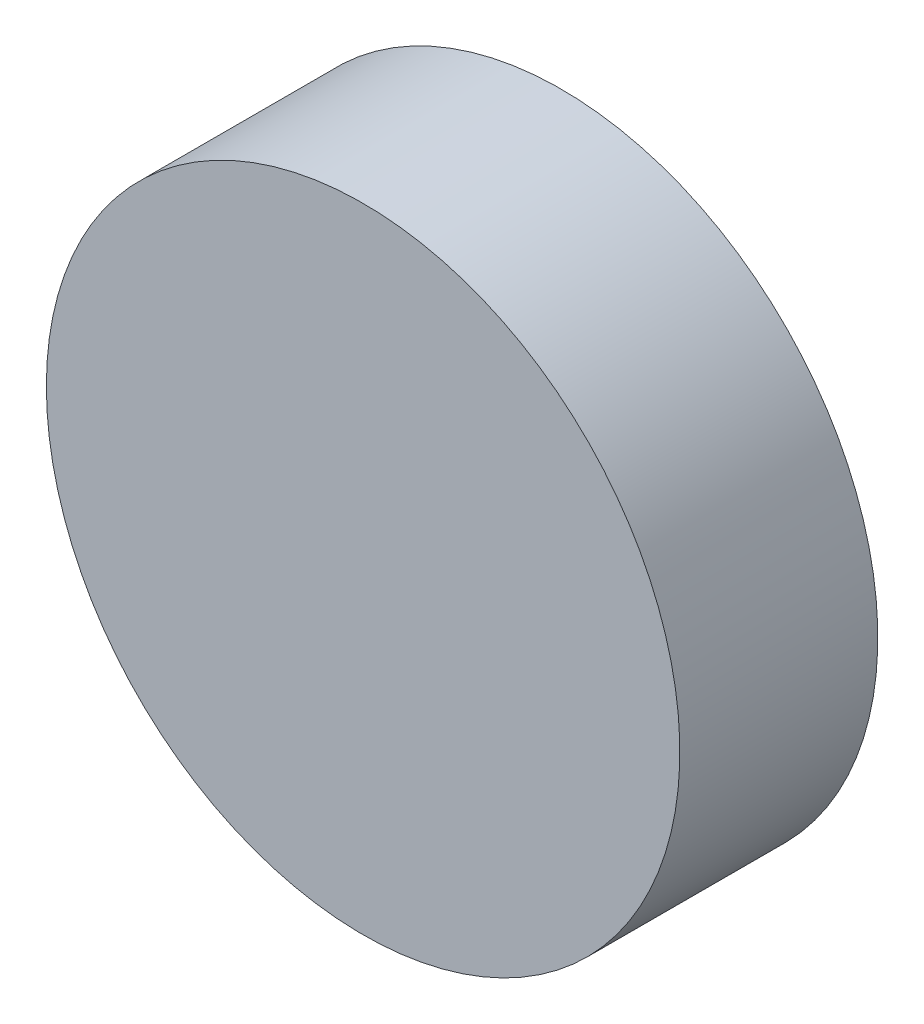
ISO-10303-21;
HEADER;
FILE_DESCRIPTION(('STEP AP214'),'2;1');
FILE_NAME('part.step','',(''),(''),'','','');
FILE_SCHEMA(('AUTOMOTIVE_DESIGN { 1 0 10303 214 1 1 1 1 }'));
ENDSEC;
DATA;
#1=APPLICATION_CONTEXT('core data for automotive mechanical design processes');
#2=APPLICATION_PROTOCOL_DEFINITION('international standard','automotive_design',2000,#1);
#3=PRODUCT_CONTEXT('',#1,'mechanical');
#4=PRODUCT('Part','Part','',(#3));
#5=PRODUCT_RELATED_PRODUCT_CATEGORY('part','',(#4));
#6=PRODUCT_DEFINITION_FORMATION('','',#4);
#7=PRODUCT_DEFINITION_CONTEXT('part definition',#1,'design');
#8=PRODUCT_DEFINITION('design','',#6,#7);
#9=PRODUCT_DEFINITION_SHAPE('','',#8);
#10=(LENGTH_UNIT() NAMED_UNIT(*) SI_UNIT(.MILLI.,.METRE.));
#11=(NAMED_UNIT(*) PLANE_ANGLE_UNIT() SI_UNIT($,.RADIAN.));
#12=(NAMED_UNIT(*) SI_UNIT($,.STERADIAN.) SOLID_ANGLE_UNIT());
#13=UNCERTAINTY_MEASURE_WITH_UNIT(LENGTH_MEASURE(1.E-05),#10,'distance_accuracy_value','');
#14=(GEOMETRIC_REPRESENTATION_CONTEXT(3) GLOBAL_UNCERTAINTY_ASSIGNED_CONTEXT((#13)) GLOBAL_UNIT_ASSIGNED_CONTEXT((#10,
#11,#12)) REPRESENTATION_CONTEXT('',''));
#15=CARTESIAN_POINT('',(0.,0.,0.));
#16=DIRECTION('',(0.,0.,1.));
#17=DIRECTION('',(1.,0.,0.));
#18=AXIS2_PLACEMENT_3D('',#15,#16,#17);
#19=CARTESIAN_POINT('',(3.048,0.,0.));
#20=DIRECTION('',(0.,0.,-1.));
#21=DIRECTION('',(-1.,0.,0.));
#22=AXIS2_PLACEMENT_3D('',#19,#20,#21);
#23=PLANE('',#22);
#24=CARTESIAN_POINT('',(0.,0.,0.));
#25=DIRECTION('',(0.,0.,-1.));
#26=DIRECTION('',(-1.,0.,0.));
#27=AXIS2_PLACEMENT_3D('',#24,#25,#26);
#28=CIRCLE('',#27,3.048);
#29=CARTESIAN_POINT('',(-3.048,0.,0.));
#30=VERTEX_POINT('',#29);
#31=EDGE_CURVE('E18',#30,#30,#28,.F.);
#32=ORIENTED_EDGE('',*,*,#31,.F.);
#33=EDGE_LOOP('',(#32));
#34=FACE_BOUND('',#33,.T.);
#35=ADVANCED_FACE('F15',(#34),#23,.T.);
#36=CARTESIAN_POINT('',(3.048,0.,1.905));
#37=DIRECTION('',(0.,0.,-1.));
#38=DIRECTION('',(-1.,0.,0.));
#39=AXIS2_PLACEMENT_3D('',#36,#37,#38);
#40=PLANE('',#39);
#41=CARTESIAN_POINT('',(0.,0.,1.905));
#42=DIRECTION('',(0.,0.,-1.));
#43=DIRECTION('',(-1.,0.,0.));
#44=AXIS2_PLACEMENT_3D('',#41,#42,#43);
#45=CIRCLE('',#44,3.048);
#46=CARTESIAN_POINT('',(-3.048,0.,1.905));
#47=VERTEX_POINT('',#46);
#48=EDGE_CURVE('E10',#47,#47,#45,.T.);
#49=ORIENTED_EDGE('',*,*,#48,.F.);
#50=EDGE_LOOP('',(#49));
#51=FACE_BOUND('',#50,.T.);
#52=ADVANCED_FACE('F30',(#51),#40,.F.);
#53=CARTESIAN_POINT('',(0.,0.,0.));
#54=DIRECTION('',(0.,0.,-1.));
#55=DIRECTION('',(-1.,0.,0.));
#56=AXIS2_PLACEMENT_3D('',#53,#54,#55);
#57=CYLINDRICAL_SURFACE('',#56,3.048);
#58=ORIENTED_EDGE('',*,*,#31,.T.);
#59=EDGE_LOOP('',(#58));
#60=FACE_BOUND('',#59,.T.);
#61=ORIENTED_EDGE('',*,*,#48,.T.);
#62=EDGE_LOOP('',(#61));
#63=FACE_BOUND('',#62,.T.);
#64=ADVANCED_FACE('F27',(#60,#63),#57,.T.);
#65=CLOSED_SHELL('',(#35,#52,#64));
#66=MANIFOLD_SOLID_BREP('B1',#65);
#67=ADVANCED_BREP_SHAPE_REPRESENTATION('',(#18,#66),#14);
#68=SHAPE_DEFINITION_REPRESENTATION(#9,#67);
ENDSEC;
END-ISO-10303-21;
